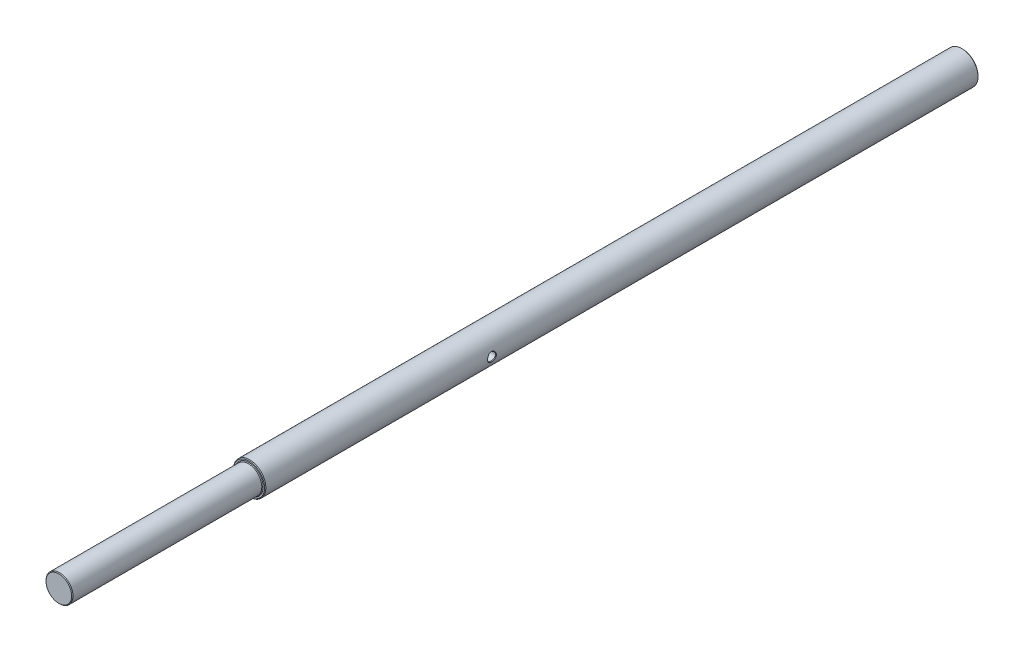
ISO-10303-21;
HEADER;
FILE_DESCRIPTION(('STEP AP214'),'2;1');
FILE_NAME('part.step','',(''),(''),'','','');
FILE_SCHEMA(('AUTOMOTIVE_DESIGN { 1 0 10303 214 1 1 1 1 }'));
ENDSEC;
DATA;
#1=APPLICATION_CONTEXT('core data for automotive mechanical design processes');
#2=APPLICATION_PROTOCOL_DEFINITION('international standard','automotive_design',2000,#1);
#3=PRODUCT_CONTEXT('',#1,'mechanical');
#4=PRODUCT('Part','Part','',(#3));
#5=PRODUCT_RELATED_PRODUCT_CATEGORY('part','',(#4));
#6=PRODUCT_DEFINITION_FORMATION('','',#4);
#7=PRODUCT_DEFINITION_CONTEXT('part definition',#1,'design');
#8=PRODUCT_DEFINITION('design','',#6,#7);
#9=PRODUCT_DEFINITION_SHAPE('','',#8);
#10=(LENGTH_UNIT() NAMED_UNIT(*) SI_UNIT(.MILLI.,.METRE.));
#11=(NAMED_UNIT(*) PLANE_ANGLE_UNIT() SI_UNIT($,.RADIAN.));
#12=(NAMED_UNIT(*) SI_UNIT($,.STERADIAN.) SOLID_ANGLE_UNIT());
#13=UNCERTAINTY_MEASURE_WITH_UNIT(LENGTH_MEASURE(1.E-05),#10,'distance_accuracy_value','');
#14=(GEOMETRIC_REPRESENTATION_CONTEXT(3) GLOBAL_UNCERTAINTY_ASSIGNED_CONTEXT((#13)) GLOBAL_UNIT_ASSIGNED_CONTEXT((#10,
#11,#12)) REPRESENTATION_CONTEXT('',''));
#15=CARTESIAN_POINT('',(0.,0.,0.));
#16=DIRECTION('',(0.,0.,1.));
#17=DIRECTION('',(1.,0.,0.));
#18=AXIS2_PLACEMENT_3D('',#15,#16,#17);
#19=CARTESIAN_POINT('',(0.,0.,70.5));
#20=DIRECTION('',(0.,0.,-1.));
#21=DIRECTION('',(-1.,0.,0.));
#22=AXIS2_PLACEMENT_3D('',#19,#20,#21);
#23=CYLINDRICAL_SURFACE('',#22,5.);
#24=CARTESIAN_POINT('',(0.,0.,0.249999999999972));
#25=DIRECTION('',(0.,0.,-1.));
#26=DIRECTION('',(-1.,0.,0.));
#27=AXIS2_PLACEMENT_3D('',#24,#25,#26);
#28=CIRCLE('',#27,5.);
#29=CARTESIAN_POINT('',(-5.,0.,0.249999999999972));
#30=VERTEX_POINT('',#29);
#31=EDGE_CURVE('E39',#30,#30,#28,.F.);
#32=ORIENTED_EDGE('',*,*,#31,.T.);
#33=EDGE_LOOP('',(#32));
#34=FACE_BOUND('',#33,.T.);
#35=CARTESIAN_POINT('',(0.,0.,70.25));
#36=DIRECTION('',(0.,0.,1.));
#37=DIRECTION('',(1.,0.,0.));
#38=AXIS2_PLACEMENT_3D('',#35,#36,#37);
#39=CIRCLE('',#38,5.);
#40=CARTESIAN_POINT('',(5.,0.,70.25));
#41=VERTEX_POINT('',#40);
#42=EDGE_CURVE('E44',#41,#41,#39,.F.);
#43=ORIENTED_EDGE('',*,*,#42,.T.);
#44=EDGE_LOOP('',(#43));
#45=FACE_BOUND('',#44,.T.);
#46=ADVANCED_FACE('F29',(#34,#45),#23,.T.);
#47=CARTESIAN_POINT('',(0.,0.,70.5));
#48=DIRECTION('',(0.,0.,1.));
#49=DIRECTION('',(1.,0.,0.));
#50=AXIS2_PLACEMENT_3D('',#47,#48,#49);
#51=PLANE('',#50);
#52=CARTESIAN_POINT('',(0.,0.,70.5));
#53=DIRECTION('',(0.,0.,1.));
#54=DIRECTION('',(1.,0.,0.));
#55=AXIS2_PLACEMENT_3D('',#52,#53,#54);
#56=CIRCLE('',#55,4.74999999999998);
#57=CARTESIAN_POINT('',(4.74999999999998,0.,70.5));
#58=VERTEX_POINT('',#57);
#59=EDGE_CURVE('E10',#58,#58,#56,.T.);
#60=ORIENTED_EDGE('',*,*,#59,.T.);
#61=EDGE_LOOP('',(#60));
#62=FACE_BOUND('',#61,.T.);
#63=ADVANCED_FACE('F160',(#62),#51,.T.);
#64=CARTESIAN_POINT('',(0.,0.,0.));
#65=DIRECTION('',(0.,0.,-1.));
#66=DIRECTION('',(-1.,0.,0.));
#67=AXIS2_PLACEMENT_3D('',#64,#65,#66);
#68=PLANE('',#67);
#69=CARTESIAN_POINT('',(0.,0.,0.));
#70=DIRECTION('',(0.,0.,-1.));
#71=DIRECTION('',(-1.,0.,0.));
#72=AXIS2_PLACEMENT_3D('',#69,#70,#71);
#73=CIRCLE('',#72,5.75000000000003);
#74=CARTESIAN_POINT('',(-5.75000000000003,0.,0.));
#75=VERTEX_POINT('',#74);
#76=EDGE_CURVE('E113',#75,#75,#73,.F.);
#77=ORIENTED_EDGE('',*,*,#76,.T.);
#78=EDGE_LOOP('',(#77));
#79=FACE_BOUND('',#78,.T.);
#80=CARTESIAN_POINT('',(0.,0.,0.));
#81=DIRECTION('',(0.,0.,-1.));
#82=DIRECTION('',(-1.,0.,0.));
#83=AXIS2_PLACEMENT_3D('',#80,#81,#82);
#84=CIRCLE('',#83,5.24999999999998);
#85=CARTESIAN_POINT('',(-5.24999999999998,0.,0.));
#86=VERTEX_POINT('',#85);
#87=EDGE_CURVE('E118',#86,#86,#84,.T.);
#88=ORIENTED_EDGE('',*,*,#87,.T.);
#89=EDGE_LOOP('',(#88));
#90=FACE_BOUND('',#89,.T.);
#91=ADVANCED_FACE('F166',(#79,#90),#68,.F.);
#92=CARTESIAN_POINT('',(0.,0.,-264.5));
#93=DIRECTION('',(0.,0.,1.));
#94=DIRECTION('',(1.,0.,0.));
#95=AXIS2_PLACEMENT_3D('',#92,#93,#94);
#96=CYLINDRICAL_SURFACE('',#95,6.);
#97=CARTESIAN_POINT('',(0.,0.,-0.250000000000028));
#98=DIRECTION('',(0.,0.,-1.));
#99=DIRECTION('',(-1.,0.,0.));
#100=AXIS2_PLACEMENT_3D('',#97,#98,#99);
#101=CIRCLE('',#100,6.);
#102=CARTESIAN_POINT('',(-6.,0.,-0.250000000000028));
#103=VERTEX_POINT('',#102);
#104=EDGE_CURVE('E179',#103,#103,#101,.T.);
#105=ORIENTED_EDGE('',*,*,#104,.T.);
#106=EDGE_LOOP('',(#105));
#107=FACE_BOUND('',#106,.T.);
#108=CARTESIAN_POINT('',(0.,0.,-264.25));
#109=DIRECTION('',(0.,0.,-1.));
#110=DIRECTION('',(-1.,0.,0.));
#111=AXIS2_PLACEMENT_3D('',#108,#109,#110);
#112=CIRCLE('',#111,6.);
#113=CARTESIAN_POINT('',(-6.,0.,-264.25));
#114=VERTEX_POINT('',#113);
#115=EDGE_CURVE('E181',#114,#114,#112,.F.);
#116=ORIENTED_EDGE('',*,*,#115,.T.);
#117=EDGE_LOOP('',(#116));
#118=FACE_BOUND('',#117,.T.);
#119=CARTESIAN_POINT('',(-6.00000000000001,0.,-85.728156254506));
#120=CARTESIAN_POINT('',(-6.00000384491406,-0.0279468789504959,-85.7281713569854));
#121=CARTESIAN_POINT('',(-5.9997883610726,-0.0558928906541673,-85.727490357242));
#122=CARTESIAN_POINT('',(-5.99894084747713,-0.111656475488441,-85.7247592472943));
#123=CARTESIAN_POINT('',(-5.99830964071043,-0.139474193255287,-85.7227118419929));
#124=CARTESIAN_POINT('',(-5.99665389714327,-0.194923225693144,-85.7172750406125));
#125=CARTESIAN_POINT('',(-5.99562995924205,-0.222554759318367,-85.7138876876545));
#126=CARTESIAN_POINT('',(-5.99321217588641,-0.277574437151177,-85.705798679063));
#127=CARTESIAN_POINT('',(-5.99181877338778,-0.30496283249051,-85.7010985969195));
#128=CARTESIAN_POINT('',(-5.98868534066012,-0.359439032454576,-85.6904114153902));
#129=CARTESIAN_POINT('',(-5.98694565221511,-0.386527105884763,-85.6844255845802));
#130=CARTESIAN_POINT('',(-5.98314289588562,-0.440345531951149,-85.6711940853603));
#131=CARTESIAN_POINT('',(-5.98108011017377,-0.467076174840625,-85.6639495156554));
#132=CARTESIAN_POINT('',(-5.97665436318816,-0.520122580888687,-85.6482275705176));
#133=CARTESIAN_POINT('',(-5.97429165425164,-0.546438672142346,-85.6397512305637));
#134=CARTESIAN_POINT('',(-5.96928923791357,-0.59859879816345,-85.6215926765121));
#135=CARTESIAN_POINT('',(-5.96664977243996,-0.624443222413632,-85.611911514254));
#136=CARTESIAN_POINT('',(-5.96111700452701,-0.675602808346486,-85.591370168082));
#137=CARTESIAN_POINT('',(-5.95822394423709,-0.700918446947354,-85.5805111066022));
#138=CARTESIAN_POINT('',(-5.9522071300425,-0.75096322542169,-85.5576407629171));
#139=CARTESIAN_POINT('',(-5.94908362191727,-0.775692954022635,-85.5456307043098));
#140=CARTESIAN_POINT('',(-5.94262908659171,-0.824508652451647,-85.5204851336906));
#141=CARTESIAN_POINT('',(-5.93929830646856,-0.848595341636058,-85.5073509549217));
#142=CARTESIAN_POINT('',(-5.93245227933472,-0.896067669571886,-85.4799839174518));
#143=CARTESIAN_POINT('',(-5.9289372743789,-0.919454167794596,-85.465752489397));
#144=CARTESIAN_POINT('',(-5.9217463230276,-0.965468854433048,-85.436217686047));
#145=CARTESIAN_POINT('',(-5.91807060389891,-0.98809803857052,-85.4209158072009));
#146=CARTESIAN_POINT('',(-5.9105800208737,-1.03254068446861,-85.3892670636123));
#147=CARTESIAN_POINT('',(-5.90676536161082,-1.05435525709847,-85.3729217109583));
#148=CARTESIAN_POINT('',(-5.89902517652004,-1.09711187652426,-85.3392122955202));
#149=CARTESIAN_POINT('',(-5.89509981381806,-1.11805510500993,-85.3218496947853));
#150=CARTESIAN_POINT('',(-5.88714240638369,-1.15901009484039,-85.2861348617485));
#151=CARTESIAN_POINT('',(-5.88311050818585,-1.17902304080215,-85.2677839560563));
#152=CARTESIAN_POINT('',(-5.87503586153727,-1.21805770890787,-85.2301201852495));
#153=CARTESIAN_POINT('',(-5.87099314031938,-1.23708094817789,-85.2108088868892));
#154=CARTESIAN_POINT('',(-5.86299552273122,-1.27410451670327,-85.1712802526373));
#155=CARTESIAN_POINT('',(-5.85904047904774,-1.29210665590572,-85.1510646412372));
#156=CARTESIAN_POINT('',(-5.85122510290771,-1.32705817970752,-85.1097855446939));
#157=CARTESIAN_POINT('',(-5.84736462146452,-1.34400929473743,-85.0887235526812));
#158=CARTESIAN_POINT('',(-5.83976927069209,-1.37683102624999,-85.0458070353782));
#159=CARTESIAN_POINT('',(-5.83603420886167,-1.39270334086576,-85.0239538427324));
#160=CARTESIAN_POINT('',(-5.82871418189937,-1.42333909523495,-84.9795109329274));
#161=CARTESIAN_POINT('',(-5.82512898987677,-1.43810424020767,-84.95692242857));
#162=CARTESIAN_POINT('',(-5.81813490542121,-1.46649739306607,-84.9110646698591));
#163=CARTESIAN_POINT('',(-5.81472574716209,-1.48012713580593,-84.8877965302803));
#164=CARTESIAN_POINT('',(-5.8081094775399,-1.50622115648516,-84.8406353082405));
#165=CARTESIAN_POINT('',(-5.80490206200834,-1.51868720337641,-84.8167432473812));
#166=CARTESIAN_POINT('',(-5.7987151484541,-1.54242551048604,-84.7683899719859));
#167=CARTESIAN_POINT('',(-5.79573531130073,-1.55369955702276,-84.7439296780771));
#168=CARTESIAN_POINT('',(-5.79002938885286,-1.57502555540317,-84.6944957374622));
#169=CARTESIAN_POINT('',(-5.78730293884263,-1.58507927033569,-84.6695228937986));
#170=CARTESIAN_POINT('',(-5.78212962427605,-1.60393633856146,-84.6191196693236));
#171=CARTESIAN_POINT('',(-5.77968238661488,-1.61274136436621,-84.5936899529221));
#172=CARTESIAN_POINT('',(-5.77509330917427,-1.62907285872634,-84.5424288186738));
#173=CARTESIAN_POINT('',(-5.77295111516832,-1.63660081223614,-84.5165979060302));
#174=CARTESIAN_POINT('',(-5.76899791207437,-1.65035005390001,-84.4645902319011));
#175=CARTESIAN_POINT('',(-5.76718660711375,-1.65657251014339,-84.438413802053));
#176=CARTESIAN_POINT('',(-5.76392091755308,-1.66768282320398,-84.3857709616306));
#177=CARTESIAN_POINT('',(-5.76246634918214,-1.67257136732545,-84.3593047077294));
#178=CARTESIAN_POINT('',(-5.75993984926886,-1.68098593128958,-84.3061380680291));
#179=CARTESIAN_POINT('',(-5.75886791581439,-1.68451195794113,-84.2794376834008));
#180=CARTESIAN_POINT('',(-5.75713219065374,-1.69017435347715,-84.225858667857));
#181=CARTESIAN_POINT('',(-5.756468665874,-1.69230981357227,-84.1989799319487));
#182=CARTESIAN_POINT('',(-5.75557569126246,-1.69516198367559,-84.1450998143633));
#183=CARTESIAN_POINT('',(-5.75534688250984,-1.69587659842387,-84.1180983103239));
#184=CARTESIAN_POINT('',(-5.75534722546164,-1.69586648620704,-84.0640952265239));
#185=CARTESIAN_POINT('',(-5.75557638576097,-1.69514173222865,-84.0370936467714));
#186=CARTESIAN_POINT('',(-5.75646731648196,-1.69228127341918,-83.9832124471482));
#187=CARTESIAN_POINT('',(-5.7571284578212,-1.69014762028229,-83.9563327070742));
#188=CARTESIAN_POINT('',(-5.75885779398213,-1.68449632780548,-83.9027504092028));
#189=CARTESIAN_POINT('',(-5.75992572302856,-1.6809795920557,-83.876047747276));
#190=CARTESIAN_POINT('',(-5.76244268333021,-1.67259099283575,-83.8228748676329));
#191=CARTESIAN_POINT('',(-5.7638917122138,-1.66771913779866,-83.7964046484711));
#192=CARTESIAN_POINT('',(-5.76714515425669,-1.6566483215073,-83.7437518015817));
#193=CARTESIAN_POINT('',(-5.76894974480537,-1.65044869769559,-83.7175693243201));
#194=CARTESIAN_POINT('',(-5.77288863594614,-1.63675029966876,-83.665547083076));
#195=CARTESIAN_POINT('',(-5.77502322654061,-1.62925038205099,-83.6397076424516));
#196=CARTESIAN_POINT('',(-5.77959651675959,-1.6129791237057,-83.5884265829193));
#197=CARTESIAN_POINT('',(-5.78203556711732,-1.60420631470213,-83.5629854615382));
#198=CARTESIAN_POINT('',(-5.78719222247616,-1.58541685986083,-83.5125561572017));
#199=CARTESIAN_POINT('',(-5.78991020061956,-1.57539854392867,-83.4875686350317));
#200=CARTESIAN_POINT('',(-5.79559919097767,-1.55414553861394,-83.4381016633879));
#201=CARTESIAN_POINT('',(-5.79857057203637,-1.54290906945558,-83.4136230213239));
#202=CARTESIAN_POINT('',(-5.80474088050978,-1.51924713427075,-83.3652289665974));
#203=CARTESIAN_POINT('',(-5.80794015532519,-1.50681984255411,-83.3413144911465));
#204=CARTESIAN_POINT('',(-5.81454074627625,-1.48080357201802,-83.2941039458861));
#205=CARTESIAN_POINT('',(-5.8179423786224,-1.46721275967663,-83.2708089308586));
#206=CARTESIAN_POINT('',(-5.82492231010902,-1.43889674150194,-83.2248925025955));
#207=CARTESIAN_POINT('',(-5.82850089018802,-1.42416970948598,-83.2022722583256));
#208=CARTESIAN_POINT('',(-5.83580888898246,-1.39360845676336,-83.1577605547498));
#209=CARTESIAN_POINT('',(-5.83953855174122,-1.3777724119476,-83.1358703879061));
#210=CARTESIAN_POINT('',(-5.84712459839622,-1.34502062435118,-83.0928740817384));
#211=CARTESIAN_POINT('',(-5.85098119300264,-1.32810303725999,-83.0717693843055));
#212=CARTESIAN_POINT('',(-5.85879058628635,-1.29321463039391,-83.0303989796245));
#213=CARTESIAN_POINT('',(-5.86274355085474,-1.2752419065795,-83.0101349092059));
#214=CARTESIAN_POINT('',(-5.87073911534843,-1.23827365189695,-82.9705016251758));
#215=CARTESIAN_POINT('',(-5.87478188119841,-1.21927611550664,-82.9511343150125));
#216=CARTESIAN_POINT('',(-5.88285828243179,-1.18028636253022,-82.9133587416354));
#217=CARTESIAN_POINT('',(-5.88689189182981,-1.16029256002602,-82.8949521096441));
#218=CARTESIAN_POINT('',(-5.89485352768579,-1.1193680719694,-82.8591341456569));
#219=CARTESIAN_POINT('',(-5.89878141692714,-1.09843625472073,-82.8417240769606));
#220=CARTESIAN_POINT('',(-5.90652741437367,-1.05569695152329,-82.8079259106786));
#221=CARTESIAN_POINT('',(-5.91034536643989,-1.03388831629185,-82.7915392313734));
#222=CARTESIAN_POINT('',(-5.91784321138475,-0.989452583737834,-82.7598137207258));
#223=CARTESIAN_POINT('',(-5.92152290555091,-0.96682439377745,-82.7444763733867));
#224=CARTESIAN_POINT('',(-5.92872240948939,-0.920807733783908,-82.7148757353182));
#225=CARTESIAN_POINT('',(-5.93224199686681,-0.897418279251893,-82.7006139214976));
#226=CARTESIAN_POINT('',(-5.93909771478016,-0.84993694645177,-82.6731905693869));
#227=CARTESIAN_POINT('',(-5.9424336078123,-0.82584421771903,-82.6600304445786));
#228=CARTESIAN_POINT('',(-5.94889881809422,-0.77701424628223,-82.6348367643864));
#229=CARTESIAN_POINT('',(-5.95202789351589,-0.752276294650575,-82.6228045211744));
#230=CARTESIAN_POINT('',(-5.95805621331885,-0.702213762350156,-82.5998929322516));
#231=CARTESIAN_POINT('',(-5.96095521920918,-0.676888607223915,-82.5890147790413));
#232=CARTESIAN_POINT('',(-5.96650016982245,-0.625709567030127,-82.5684377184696));
#233=CARTESIAN_POINT('',(-5.96914588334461,-0.599855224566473,-82.558739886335));
#234=CARTESIAN_POINT('',(-5.97416100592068,-0.547675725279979,-82.5405498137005));
#235=CARTESIAN_POINT('',(-5.97653018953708,-0.521350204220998,-82.5320585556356));
#236=CARTESIAN_POINT('',(-5.98096901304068,-0.468286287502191,-82.5163079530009));
#237=CARTESIAN_POINT('',(-5.98303842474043,-0.441547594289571,-82.5090495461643));
#238=CARTESIAN_POINT('',(-5.98685447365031,-0.387715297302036,-82.4957909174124));
#239=CARTESIAN_POINT('',(-5.98860086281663,-0.360621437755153,-82.4897916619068));
#240=CARTESIAN_POINT('',(-5.9917476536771,-0.30613679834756,-82.4790775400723));
#241=CARTESIAN_POINT('',(-5.99314776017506,-0.278745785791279,-82.474363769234));
#242=CARTESIAN_POINT('',(-5.99557880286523,-0.223724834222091,-82.4662466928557));
#243=CARTESIAN_POINT('',(-5.9966093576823,-0.196094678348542,-82.4628447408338));
#244=CARTESIAN_POINT('',(-5.9982781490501,-0.140653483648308,-82.4573773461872));
#245=CARTESIAN_POINT('',(-5.99891586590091,-0.112842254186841,-82.4553136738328));
#246=CARTESIAN_POINT('',(-5.99977590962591,-0.0570967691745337,-82.4525483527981));
#247=CARTESIAN_POINT('',(-5.99999751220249,-0.0291623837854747,-82.4518490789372));
#248=CARTESIAN_POINT('',(-6.00000223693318,0.0267114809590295,-82.4518392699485));
#249=CARTESIAN_POINT('',(-5.99978528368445,0.0546509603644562,-82.4525289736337));
#250=CARTESIAN_POINT('',(-5.9989345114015,0.110415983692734,-82.4552764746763));
#251=CARTESIAN_POINT('',(-5.998301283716,0.138241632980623,-82.4573323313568));
#252=CARTESIAN_POINT('',(-5.99664145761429,0.193719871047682,-82.4627843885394));
#253=CARTESIAN_POINT('',(-5.99561526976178,0.221372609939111,-82.4661791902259));
#254=CARTESIAN_POINT('',(-5.99319290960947,0.276445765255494,-82.4742820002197));
#255=CARTESIAN_POINT('',(-5.99179703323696,0.303866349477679,-82.4789889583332));
#256=CARTESIAN_POINT('',(-5.98865862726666,0.358415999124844,-82.4896890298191));
#257=CARTESIAN_POINT('',(-5.98691633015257,0.385545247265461,-82.4956812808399));
#258=CARTESIAN_POINT('',(-5.98310836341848,0.439453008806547,-82.5089250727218));
#259=CARTESIAN_POINT('',(-5.9810429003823,0.466231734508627,-82.5161758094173));
#260=CARTESIAN_POINT('',(-5.97661184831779,0.519379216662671,-82.5319098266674));
#261=CARTESIAN_POINT('',(-5.97424646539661,0.545748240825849,-82.5403922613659));
#262=CARTESIAN_POINT('',(-5.96923879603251,0.598017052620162,-82.5585630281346));
#263=CARTESIAN_POINT('',(-5.96659673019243,0.623917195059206,-82.5682504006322));
#264=CARTESIAN_POINT('',(-5.96105890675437,0.675188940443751,-82.5888044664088));
#265=CARTESIAN_POINT('',(-5.9581633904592,0.700561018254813,-82.5996700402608));
#266=CARTESIAN_POINT('',(-5.95214186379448,0.750717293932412,-82.6225539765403));
#267=CARTESIAN_POINT('',(-5.94901611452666,0.775502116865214,-82.6345710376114));
#268=CARTESIAN_POINT('',(-5.94255735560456,0.824424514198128,-82.6597314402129));
#269=CARTESIAN_POINT('',(-5.93922462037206,0.848562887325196,-82.672873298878));
#270=CARTESIAN_POINT('',(-5.93237500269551,0.896132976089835,-82.7002567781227));
#271=CARTESIAN_POINT('',(-5.92885839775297,0.919565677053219,-82.7144967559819));
#272=CARTESIAN_POINT('',(-5.92166463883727,0.965665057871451,-82.7440499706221));
#273=CARTESIAN_POINT('',(-5.91798775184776,0.988332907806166,-82.7593614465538));
#274=CARTESIAN_POINT('',(-5.91049527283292,1.0328430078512,-82.7910309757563));
#275=CARTESIAN_POINT('',(-5.90667992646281,1.05468659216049,-82.8073872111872));
#276=CARTESIAN_POINT('',(-5.89893896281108,1.09748941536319,-82.841120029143));
#277=CARTESIAN_POINT('',(-5.89501354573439,1.11845010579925,-82.8584948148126));
#278=CARTESIAN_POINT('',(-5.88705640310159,1.15942542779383,-82.8942365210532));
#279=CARTESIAN_POINT('',(-5.88302486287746,1.1794415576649,-82.912601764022));
#280=CARTESIAN_POINT('',(-5.87495162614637,1.21847236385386,-82.9502983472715));
#281=CARTESIAN_POINT('',(-5.87090995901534,1.23748870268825,-82.9696279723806));
#282=CARTESIAN_POINT('',(-5.86291527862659,1.27449567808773,-83.0091972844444));
#283=CARTESIAN_POINT('',(-5.85896212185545,1.29248806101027,-83.0294353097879));
#284=CARTESIAN_POINT('',(-5.85115095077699,1.32741727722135,-83.0707628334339));
#285=CARTESIAN_POINT('',(-5.84729279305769,1.34435576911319,-83.0918509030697));
#286=CARTESIAN_POINT('',(-5.83970247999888,1.37715030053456,-83.1348219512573));
#287=CARTESIAN_POINT('',(-5.83597014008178,1.39300796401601,-83.1567036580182));
#288=CARTESIAN_POINT('',(-5.8286558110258,1.42361306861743,-83.2012049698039));
#289=CARTESIAN_POINT('',(-5.82507360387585,1.43836214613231,-83.2238234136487));
#290=CARTESIAN_POINT('',(-5.81808563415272,1.46672247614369,-83.2697413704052));
#291=CARTESIAN_POINT('',(-5.81467961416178,1.48033540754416,-83.2930398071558));
#292=CARTESIAN_POINT('',(-5.80806965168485,1.50639575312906,-83.3402609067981));
#293=CARTESIAN_POINT('',(-5.80486541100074,1.51884490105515,-83.3641825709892));
#294=CARTESIAN_POINT('',(-5.79868476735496,1.54254998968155,-83.4125932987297));
#295=CARTESIAN_POINT('',(-5.79570802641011,1.55380771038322,-83.4370814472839));
#296=CARTESIAN_POINT('',(-5.79000810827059,1.57510225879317,-83.4865683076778));
#297=CARTESIAN_POINT('',(-5.78728455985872,1.58514088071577,-83.5115662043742));
#298=CARTESIAN_POINT('',(-5.78211675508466,1.60396957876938,-83.5620157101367));
#299=CARTESIAN_POINT('',(-5.77967210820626,1.61276140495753,-83.587466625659));
#300=CARTESIAN_POINT('',(-5.7750878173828,1.62906891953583,-83.6387652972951));
#301=CARTESIAN_POINT('',(-5.77294778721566,1.63658622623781,-83.6646125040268));
#302=CARTESIAN_POINT('',(-5.76899841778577,1.65031719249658,-83.7166468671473));
#303=CARTESIAN_POINT('',(-5.7671887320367,1.65653221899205,-83.7428336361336));
#304=CARTESIAN_POINT('',(-5.76392569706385,1.66763126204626,-83.7954902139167));
#305=CARTESIAN_POINT('',(-5.76247209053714,1.67251623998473,-83.8219598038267));
#306=CARTESIAN_POINT('',(-5.75994682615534,1.68092788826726,-83.8751251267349));
#307=CARTESIAN_POINT('',(-5.75887506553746,1.68445492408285,-83.9018207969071));
#308=CARTESIAN_POINT('',(-5.75713896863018,1.69012392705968,-83.9553813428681));
#309=CARTESIAN_POINT('',(-5.75647476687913,1.69226543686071,-83.9822462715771));
#310=CARTESIAN_POINT('',(-5.75557943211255,1.69513557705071,-84.0360886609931));
#311=CARTESIAN_POINT('',(-5.7553487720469,1.6958626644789,-84.0630662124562));
#312=CARTESIAN_POINT('',(-5.75534511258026,1.69588117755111,-84.1170159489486));
#313=CARTESIAN_POINT('',(-5.75557201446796,1.69517291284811,-84.1439881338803));
#314=CARTESIAN_POINT('',(-5.7564587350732,1.69234632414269,-84.1978102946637));
#315=CARTESIAN_POINT('',(-5.75711790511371,1.6902301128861,-84.2246603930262));
#316=CARTESIAN_POINT('',(-5.75884339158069,1.68461472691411,-84.2781832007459));
#317=CARTESIAN_POINT('',(-5.75990942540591,1.68111651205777,-84.3048560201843));
#318=CARTESIAN_POINT('',(-5.76242273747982,1.67276519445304,-84.3579690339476));
#319=CARTESIAN_POINT('',(-5.76387000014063,1.66791214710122,-84.3844092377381));
#320=CARTESIAN_POINT('',(-5.76712002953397,1.65687865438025,-84.437001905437));
#321=CARTESIAN_POINT('',(-5.76892296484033,1.65069757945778,-84.4631542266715));
#322=CARTESIAN_POINT('',(-5.77285866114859,1.63703539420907,-84.5151160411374));
#323=CARTESIAN_POINT('',(-5.77499170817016,1.62955315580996,-84.5409252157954));
#324=CARTESIAN_POINT('',(-5.77956201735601,1.6133157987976,-84.5921456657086));
#325=CARTESIAN_POINT('',(-5.78199963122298,1.60455920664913,-84.6175564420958));
#326=CARTESIAN_POINT('',(-5.78715351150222,1.58580015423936,-84.6679250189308));
#327=CARTESIAN_POINT('',(-5.78987015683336,1.57579599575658,-84.6928821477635));
#328=CARTESIAN_POINT('',(-5.79555657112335,1.55456870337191,-84.7422883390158));
#329=CARTESIAN_POINT('',(-5.79852671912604,1.54334373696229,-84.7667365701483));
#330=CARTESIAN_POINT('',(-5.80469464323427,1.5197016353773,-84.8150698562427));
#331=CARTESIAN_POINT('',(-5.80789278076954,1.5072825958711,-84.838953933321));
#332=CARTESIAN_POINT('',(-5.814491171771,1.48127909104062,-84.8861037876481));
#333=CARTESIAN_POINT('',(-5.81789175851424,1.46769268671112,-84.909368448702));
#334=CARTESIAN_POINT('',(-5.82486966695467,1.43938117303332,-84.955224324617));
#335=CARTESIAN_POINT('',(-5.8284472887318,1.42465410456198,-84.9778142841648));
#336=CARTESIAN_POINT('',(-5.83575343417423,1.39408792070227,-85.0222656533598));
#337=CARTESIAN_POINT('',(-5.83948222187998,1.37824682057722,-85.044125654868));
#338=CARTESIAN_POINT('',(-5.84706657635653,1.3454794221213,-85.0870618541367));
#339=CARTESIAN_POINT('',(-5.85092237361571,1.32855109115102,-85.1081364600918));
#340=CARTESIAN_POINT('',(-5.85873023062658,1.29363541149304,-85.1494472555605));
#341=CARTESIAN_POINT('',(-5.86268247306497,1.27564594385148,-85.1696816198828));
#342=CARTESIAN_POINT('',(-5.87067664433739,1.23863679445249,-85.2092550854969));
#343=CARTESIAN_POINT('',(-5.87471875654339,1.21961486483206,-85.2285920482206));
#344=CARTESIAN_POINT('',(-5.88279406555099,1.18057151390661,-85.2663113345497));
#345=CARTESIAN_POINT('',(-5.88682722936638,1.16054820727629,-85.2846917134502));
#346=CARTESIAN_POINT('',(-5.89478846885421,1.11956302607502,-85.32046621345));
#347=CARTESIAN_POINT('',(-5.89871636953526,1.09859972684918,-85.3378587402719));
#348=CARTESIAN_POINT('',(-5.90646283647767,1.05579518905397,-85.3716289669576));
#349=CARTESIAN_POINT('',(-5.91028121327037,1.03395256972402,-85.3880049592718));
#350=CARTESIAN_POINT('',(-5.91778030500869,0.989447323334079,-85.4197157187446));
#351=CARTESIAN_POINT('',(-5.92146078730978,0.966783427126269,-85.4350487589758));
#352=CARTESIAN_POINT('',(-5.92866221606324,0.92069419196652,-85.4646465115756));
#353=CARTESIAN_POINT('',(-5.93218290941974,0.897267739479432,-85.4789095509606));
#354=CARTESIAN_POINT('',(-5.93904113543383,0.849711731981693,-85.5063402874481));
#355=CARTESIAN_POINT('',(-5.94237840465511,0.825581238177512,-85.5195064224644));
#356=CARTESIAN_POINT('',(-5.94884660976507,0.776675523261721,-85.5447162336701));
#357=CARTESIAN_POINT('',(-5.95197728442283,0.751899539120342,-85.5567584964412));
#358=CARTESIAN_POINT('',(-5.95800898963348,0.70176120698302,-85.5796934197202));
#359=CARTESIAN_POINT('',(-5.96090977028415,0.676398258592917,-85.5905848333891));
#360=CARTESIAN_POINT('',(-5.96645840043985,0.62514437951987,-85.6111908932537));
#361=CARTESIAN_POINT('',(-5.9691060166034,0.599252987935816,-85.6209044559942));
#362=CARTESIAN_POINT('',(-5.97412501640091,0.547000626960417,-85.6391276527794));
#363=CARTESIAN_POINT('',(-5.97649618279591,0.520639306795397,-85.6476363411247));
#364=CARTESIAN_POINT('',(-5.98093898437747,0.467505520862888,-85.6634226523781));
#365=CARTESIAN_POINT('',(-5.98301041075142,0.440732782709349,-85.6706994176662));
#366=CARTESIAN_POINT('',(-5.98683044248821,0.386834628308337,-85.6839947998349));
#367=CARTESIAN_POINT('',(-5.98857883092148,0.359708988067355,-85.6900125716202));
#368=CARTESIAN_POINT('',(-5.99172950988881,0.305163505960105,-85.7007629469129));
#369=CARTESIAN_POINT('',(-5.99313154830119,0.277743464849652,-85.7054946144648));
#370=CARTESIAN_POINT('',(-5.9955662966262,0.222667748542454,-85.7136459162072));
#371=CARTESIAN_POINT('',(-5.99659868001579,0.195011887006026,-85.7170643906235));
#372=CARTESIAN_POINT('',(-5.99827086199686,0.139522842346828,-85.7225623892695));
#373=CARTESIAN_POINT('',(-5.99891020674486,0.111689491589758,-85.7246403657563));
#374=CARTESIAN_POINT('',(-5.99977335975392,0.0559047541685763,-85.7274313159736));
#375=CARTESIAN_POINT('',(-5.99999651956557,0.0279532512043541,-85.7281421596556));
#376=CARTESIAN_POINT('',(-6.00000000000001,0.,-85.728156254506));
#377=B_SPLINE_CURVE_WITH_KNOTS('',3,(#119,#120,#121,#122,#123,#124,#125,#126,#127,#128,#129,
#130,#131,#132,#133,#134,#135,#136,#137,#138,#139,#140,#141,#142,#143,#144,#145,#146,#147,#148,
#149,#150,#151,#152,#153,#154,#155,#156,#157,#158,#159,#160,#161,#162,#163,#164,#165,#166,#167,
#168,#169,#170,#171,#172,#173,#174,#175,#176,#177,#178,#179,#180,#181,#182,#183,#184,#185,#186,
#187,#188,#189,#190,#191,#192,#193,#194,#195,#196,#197,#198,#199,#200,#201,#202,#203,#204,#205,
#206,#207,#208,#209,#210,#211,#212,#213,#214,#215,#216,#217,#218,#219,#220,#221,#222,#223,#224,
#225,#226,#227,#228,#229,#230,#231,#232,#233,#234,#235,#236,#237,#238,#239,#240,#241,#242,#243,
#244,#245,#246,#247,#248,#249,#250,#251,#252,#253,#254,#255,#256,#257,#258,#259,#260,#261,#262,
#263,#264,#265,#266,#267,#268,#269,#270,#271,#272,#273,#274,#275,#276,#277,#278,#279,#280,#281,
#282,#283,#284,#285,#286,#287,#288,#289,#290,#291,#292,#293,#294,#295,#296,#297,#298,#299,#300,
#301,#302,#303,#304,#305,#306,#307,#308,#309,#310,#311,#312,#313,#314,#315,#316,#317,#318,#319,
#320,#321,#322,#323,#324,#325,#326,#327,#328,#329,#330,#331,#332,#333,#334,#335,#336,#337,#338,
#339,#340,#341,#342,#343,#344,#345,#346,#347,#348,#349,#350,#351,#352,#353,#354,#355,#356,#357,
#358,#359,#360,#361,#362,#363,#364,#365,#366,#367,#368,#369,#370,#371,#372,#373,#374,#375,#376),
.UNSPECIFIED.,.F.,.F.,(4,2,2,2,2,2,2,2,2,2,2,2,2,2,2,2,2,2,2,2,2,2,2,2,2,2,2,2,2,2,2,2,2,2,2,2,
2,2,2,2,2,2,2,2,2,2,2,2,2,2,2,2,2,2,2,2,2,2,2,2,2,2,2,2,2,2,2,2,2,2,2,2,2,2,2,2,2,2,2,2,2,2,2,2,
2,2,2,2,2,2,2,2,2,2,2,2,2,2,2,2,2,2,2,2,2,2,2,2,2,2,2,2,2,2,2,2,2,2,2,2,2,2,2,2,2,2,2,2,4),(0.,
0.0838292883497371,0.167493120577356,0.251029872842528,0.334466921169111,0.417822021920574,
0.501104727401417,0.584317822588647,0.667458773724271,0.750521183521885,0.83349625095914,
0.916374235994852,0.999145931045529,1.08180414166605,1.16434517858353,1.24677036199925,
1.32908753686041,1.41127456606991,1.4933110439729,1.57520865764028,1.6569742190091,
1.7386111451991,1.82012095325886,1.90150476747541,1.98276483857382,2.06390607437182,
2.14493758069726,2.22587420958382,2.30673810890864,2.38756026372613,2.46838201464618,
2.549256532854,2.63025022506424,2.71124543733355,2.79212296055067,2.87294773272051,
2.95377200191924,3.03463669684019,3.11557286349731,3.19660314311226,3.2777432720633,
3.3590035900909,3.44039054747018,3.52190820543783,3.60355972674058,3.68534885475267,
3.76728138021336,3.84936659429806,3.93161872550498,4.01400625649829,4.09649601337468,
4.17909766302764,4.26181381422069,4.34464155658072,4.42757398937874,4.51060173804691,
4.59371445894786,4.67690233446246,4.76015756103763,4.84347583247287,4.92685781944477,
5.01031064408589,5.09384934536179,5.17749832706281,5.26129277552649,5.34510163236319,
5.42879168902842,5.51239454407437,5.59593067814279,5.67941093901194,5.76283805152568,
5.84620813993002,5.92951225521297,6.01273790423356,6.0958705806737,6.17889530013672,
6.26179814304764,6.34456780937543,6.42719718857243,6.50968494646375,6.59203712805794,
6.67424773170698,6.75631364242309,6.83824694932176,6.92005430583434,7.0017384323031,
7.08329963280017,7.16473732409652,7.24605157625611,7.32724466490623,7.40832263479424,
7.48929687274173,7.57018568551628,7.65101587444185,7.73182429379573,7.81265937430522,
7.89358258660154,7.97448834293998,8.05527296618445,8.13600157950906,8.21672689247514,
8.29749055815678,8.37832459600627,8.45925285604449,8.54029250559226,8.6214555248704,
8.7027502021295,8.78418262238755,8.86575814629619,8.9474828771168,9.02936511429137,
9.11141679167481,9.19365489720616,9.27605413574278,9.35858278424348,9.44124650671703,
9.52404393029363,9.60696822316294,9.69000865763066,9.77315215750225,9.85638483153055,
9.93969349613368,10.0230671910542,10.1064986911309,10.1899860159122,10.2735339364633,
10.3571554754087,10.4408733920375,10.5247216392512),.UNSPECIFIED.);
#378=CARTESIAN_POINT('',(-6.00000000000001,0.,-85.728156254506));
#379=VERTEX_POINT('',#378);
#380=EDGE_CURVE('E52',#379,#379,#377,.F.);
#381=ORIENTED_EDGE('',*,*,#380,.T.);
#382=EDGE_LOOP('',(#381));
#383=FACE_BOUND('',#382,.T.);
#384=CARTESIAN_POINT('',(6.,0.,-85.728156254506));
#385=CARTESIAN_POINT('',(6.00000384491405,0.0279468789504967,-85.7281713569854));
#386=CARTESIAN_POINT('',(5.99978836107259,0.055892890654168,-85.727490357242));
#387=CARTESIAN_POINT('',(5.99894084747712,0.111656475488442,-85.7247592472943));
#388=CARTESIAN_POINT('',(5.99830964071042,0.139474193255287,-85.7227118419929));
#389=CARTESIAN_POINT('',(5.99665389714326,0.194923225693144,-85.7172750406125));
#390=CARTESIAN_POINT('',(5.99562995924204,0.222554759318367,-85.7138876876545));
#391=CARTESIAN_POINT('',(5.9932121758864,0.277574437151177,-85.705798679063));
#392=CARTESIAN_POINT('',(5.99181877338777,0.30496283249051,-85.7010985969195));
#393=CARTESIAN_POINT('',(5.98868534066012,0.359439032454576,-85.6904114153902));
#394=CARTESIAN_POINT('',(5.9869456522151,0.386527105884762,-85.6844255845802));
#395=CARTESIAN_POINT('',(5.98314289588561,0.440345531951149,-85.6711940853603));
#396=CARTESIAN_POINT('',(5.98108011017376,0.467076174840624,-85.6639495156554));
#397=CARTESIAN_POINT('',(5.97665436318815,0.520122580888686,-85.6482275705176));
#398=CARTESIAN_POINT('',(5.97429165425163,0.546438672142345,-85.6397512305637));
#399=CARTESIAN_POINT('',(5.96928923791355,0.598598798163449,-85.6215926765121));
#400=CARTESIAN_POINT('',(5.96664977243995,0.62444322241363,-85.611911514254));
#401=CARTESIAN_POINT('',(5.961117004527,0.675602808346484,-85.591370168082));
#402=CARTESIAN_POINT('',(5.95822394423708,0.700918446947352,-85.5805111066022));
#403=CARTESIAN_POINT('',(5.95220713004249,0.750963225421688,-85.5576407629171));
#404=CARTESIAN_POINT('',(5.94908362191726,0.775692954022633,-85.5456307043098));
#405=CARTESIAN_POINT('',(5.9426290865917,0.824508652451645,-85.5204851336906));
#406=CARTESIAN_POINT('',(5.93929830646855,0.848595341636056,-85.5073509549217));
#407=CARTESIAN_POINT('',(5.93245227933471,0.896067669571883,-85.4799839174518));
#408=CARTESIAN_POINT('',(5.9289372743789,0.919454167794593,-85.465752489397));
#409=CARTESIAN_POINT('',(5.92174632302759,0.965468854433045,-85.436217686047));
#410=CARTESIAN_POINT('',(5.91807060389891,0.988098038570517,-85.4209158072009));
#411=CARTESIAN_POINT('',(5.91058002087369,1.03254068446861,-85.3892670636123));
#412=CARTESIAN_POINT('',(5.90676536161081,1.05435525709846,-85.3729217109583));
#413=CARTESIAN_POINT('',(5.89902517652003,1.09711187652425,-85.3392122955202));
#414=CARTESIAN_POINT('',(5.89509981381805,1.11805510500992,-85.3218496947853));
#415=CARTESIAN_POINT('',(5.88714240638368,1.15901009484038,-85.2861348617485));
#416=CARTESIAN_POINT('',(5.88311050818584,1.17902304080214,-85.2677839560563));
#417=CARTESIAN_POINT('',(5.87503586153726,1.21805770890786,-85.2301201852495));
#418=CARTESIAN_POINT('',(5.87099314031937,1.23708094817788,-85.2108088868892));
#419=CARTESIAN_POINT('',(5.86299552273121,1.27410451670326,-85.1712802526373));
#420=CARTESIAN_POINT('',(5.85904047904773,1.29210665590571,-85.1510646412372));
#421=CARTESIAN_POINT('',(5.8512251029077,1.32705817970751,-85.1097855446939));
#422=CARTESIAN_POINT('',(5.84736462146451,1.34400929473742,-85.0887235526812));
#423=CARTESIAN_POINT('',(5.83976927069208,1.37683102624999,-85.0458070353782));
#424=CARTESIAN_POINT('',(5.83603420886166,1.39270334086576,-85.0239538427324));
#425=CARTESIAN_POINT('',(5.82871418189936,1.42333909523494,-84.9795109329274));
#426=CARTESIAN_POINT('',(5.82512898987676,1.43810424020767,-84.95692242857));
#427=CARTESIAN_POINT('',(5.8181349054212,1.46649739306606,-84.9110646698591));
#428=CARTESIAN_POINT('',(5.81472574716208,1.48012713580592,-84.8877965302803));
#429=CARTESIAN_POINT('',(5.80810947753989,1.50622115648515,-84.8406353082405));
#430=CARTESIAN_POINT('',(5.80490206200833,1.5186872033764,-84.8167432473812));
#431=CARTESIAN_POINT('',(5.79871514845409,1.54242551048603,-84.7683899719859));
#432=CARTESIAN_POINT('',(5.79573531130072,1.55369955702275,-84.7439296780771));
#433=CARTESIAN_POINT('',(5.79002938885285,1.57502555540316,-84.6944957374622));
#434=CARTESIAN_POINT('',(5.78730293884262,1.58507927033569,-84.6695228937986));
#435=CARTESIAN_POINT('',(5.78212962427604,1.60393633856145,-84.6191196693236));
#436=CARTESIAN_POINT('',(5.77968238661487,1.6127413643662,-84.5936899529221));
#437=CARTESIAN_POINT('',(5.77509330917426,1.62907285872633,-84.5424288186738));
#438=CARTESIAN_POINT('',(5.77295111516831,1.63660081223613,-84.5165979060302));
#439=CARTESIAN_POINT('',(5.76899791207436,1.6503500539,-84.4645902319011));
#440=CARTESIAN_POINT('',(5.76718660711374,1.65657251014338,-84.438413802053));
#441=CARTESIAN_POINT('',(5.76392091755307,1.66768282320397,-84.3857709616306));
#442=CARTESIAN_POINT('',(5.76246634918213,1.67257136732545,-84.3593047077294));
#443=CARTESIAN_POINT('',(5.75993984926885,1.68098593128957,-84.3061380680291));
#444=CARTESIAN_POINT('',(5.75886791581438,1.68451195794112,-84.2794376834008));
#445=CARTESIAN_POINT('',(5.75713219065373,1.69017435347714,-84.225858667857));
#446=CARTESIAN_POINT('',(5.756468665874,1.69230981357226,-84.1989799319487));
#447=CARTESIAN_POINT('',(5.75557569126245,1.69516198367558,-84.1450998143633));
#448=CARTESIAN_POINT('',(5.75534688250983,1.69587659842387,-84.1180983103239));
#449=CARTESIAN_POINT('',(5.75534722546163,1.69586648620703,-84.0640952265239));
#450=CARTESIAN_POINT('',(5.75557638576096,1.69514173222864,-84.0370936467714));
#451=CARTESIAN_POINT('',(5.75646731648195,1.69228127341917,-83.9832124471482));
#452=CARTESIAN_POINT('',(5.75712845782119,1.69014762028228,-83.9563327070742));
#453=CARTESIAN_POINT('',(5.75885779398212,1.68449632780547,-83.9027504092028));
#454=CARTESIAN_POINT('',(5.75992572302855,1.68097959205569,-83.876047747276));
#455=CARTESIAN_POINT('',(5.7624426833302,1.67259099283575,-83.8228748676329));
#456=CARTESIAN_POINT('',(5.76389171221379,1.66771913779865,-83.7964046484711));
#457=CARTESIAN_POINT('',(5.76714515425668,1.65664832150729,-83.7437518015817));
#458=CARTESIAN_POINT('',(5.76894974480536,1.65044869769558,-83.7175693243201));
#459=CARTESIAN_POINT('',(5.77288863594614,1.63675029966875,-83.665547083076));
#460=CARTESIAN_POINT('',(5.7750232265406,1.62925038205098,-83.6397076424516));
#461=CARTESIAN_POINT('',(5.77959651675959,1.6129791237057,-83.5884265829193));
#462=CARTESIAN_POINT('',(5.78203556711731,1.60420631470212,-83.5629854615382));
#463=CARTESIAN_POINT('',(5.78719222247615,1.58541685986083,-83.5125561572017));
#464=CARTESIAN_POINT('',(5.78991020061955,1.57539854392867,-83.4875686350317));
#465=CARTESIAN_POINT('',(5.79559919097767,1.55414553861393,-83.4381016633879));
#466=CARTESIAN_POINT('',(5.79857057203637,1.54290906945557,-83.4136230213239));
#467=CARTESIAN_POINT('',(5.80474088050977,1.51924713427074,-83.3652289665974));
#468=CARTESIAN_POINT('',(5.80794015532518,1.5068198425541,-83.3413144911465));
#469=CARTESIAN_POINT('',(5.81454074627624,1.48080357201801,-83.2941039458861));
#470=CARTESIAN_POINT('',(5.81794237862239,1.46721275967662,-83.2708089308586));
#471=CARTESIAN_POINT('',(5.82492231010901,1.43889674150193,-83.2248925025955));
#472=CARTESIAN_POINT('',(5.82850089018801,1.42416970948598,-83.2022722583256));
#473=CARTESIAN_POINT('',(5.83580888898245,1.39360845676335,-83.1577605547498));
#474=CARTESIAN_POINT('',(5.83953855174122,1.37777241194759,-83.1358703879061));
#475=CARTESIAN_POINT('',(5.84712459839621,1.34502062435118,-83.0928740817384));
#476=CARTESIAN_POINT('',(5.85098119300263,1.32810303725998,-83.0717693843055));
#477=CARTESIAN_POINT('',(5.85879058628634,1.2932146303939,-83.0303989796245));
#478=CARTESIAN_POINT('',(5.86274355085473,1.27524190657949,-83.0101349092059));
#479=CARTESIAN_POINT('',(5.87073911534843,1.23827365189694,-82.9705016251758));
#480=CARTESIAN_POINT('',(5.87478188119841,1.21927611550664,-82.9511343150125));
#481=CARTESIAN_POINT('',(5.88285828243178,1.18028636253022,-82.9133587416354));
#482=CARTESIAN_POINT('',(5.8868918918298,1.16029256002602,-82.8949521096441));
#483=CARTESIAN_POINT('',(5.89485352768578,1.11936807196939,-82.8591341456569));
#484=CARTESIAN_POINT('',(5.89878141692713,1.09843625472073,-82.8417240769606));
#485=CARTESIAN_POINT('',(5.90652741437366,1.05569695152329,-82.8079259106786));
#486=CARTESIAN_POINT('',(5.91034536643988,1.03388831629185,-82.7915392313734));
#487=CARTESIAN_POINT('',(5.91784321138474,0.989452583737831,-82.7598137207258));
#488=CARTESIAN_POINT('',(5.9215229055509,0.966824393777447,-82.7444763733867));
#489=CARTESIAN_POINT('',(5.92872240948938,0.920807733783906,-82.7148757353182));
#490=CARTESIAN_POINT('',(5.9322419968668,0.897418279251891,-82.7006139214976));
#491=CARTESIAN_POINT('',(5.93909771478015,0.849936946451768,-82.6731905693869));
#492=CARTESIAN_POINT('',(5.94243360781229,0.825844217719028,-82.6600304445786));
#493=CARTESIAN_POINT('',(5.94889881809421,0.77701424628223,-82.6348367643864));
#494=CARTESIAN_POINT('',(5.95202789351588,0.752276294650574,-82.6228045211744));
#495=CARTESIAN_POINT('',(5.95805621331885,0.702213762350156,-82.5998929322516));
#496=CARTESIAN_POINT('',(5.96095521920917,0.676888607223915,-82.5890147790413));
#497=CARTESIAN_POINT('',(5.96650016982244,0.625709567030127,-82.5684377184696));
#498=CARTESIAN_POINT('',(5.96914588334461,0.599855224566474,-82.558739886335));
#499=CARTESIAN_POINT('',(5.97416100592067,0.54767572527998,-82.5405498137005));
#500=CARTESIAN_POINT('',(5.97653018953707,0.521350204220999,-82.5320585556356));
#501=CARTESIAN_POINT('',(5.98096901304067,0.468286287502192,-82.5163079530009));
#502=CARTESIAN_POINT('',(5.98303842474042,0.441547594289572,-82.5090495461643));
#503=CARTESIAN_POINT('',(5.9868544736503,0.387715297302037,-82.4957909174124));
#504=CARTESIAN_POINT('',(5.98860086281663,0.360621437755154,-82.4897916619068));
#505=CARTESIAN_POINT('',(5.99174765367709,0.306136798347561,-82.4790775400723));
#506=CARTESIAN_POINT('',(5.99314776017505,0.27874578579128,-82.474363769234));
#507=CARTESIAN_POINT('',(5.99557880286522,0.223724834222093,-82.4662466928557));
#508=CARTESIAN_POINT('',(5.99660935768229,0.196094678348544,-82.4628447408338));
#509=CARTESIAN_POINT('',(5.99827814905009,0.14065348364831,-82.4573773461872));
#510=CARTESIAN_POINT('',(5.9989158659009,0.112842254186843,-82.4553136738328));
#511=CARTESIAN_POINT('',(5.9997759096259,0.0570967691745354,-82.4525483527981));
#512=CARTESIAN_POINT('',(5.99999751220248,0.0291623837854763,-82.4518490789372));
#513=CARTESIAN_POINT('',(6.00000223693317,-0.0267114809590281,-82.4518392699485));
#514=CARTESIAN_POINT('',(5.99978528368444,-0.0546509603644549,-82.4525289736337));
#515=CARTESIAN_POINT('',(5.99893451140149,-0.110415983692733,-82.4552764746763));
#516=CARTESIAN_POINT('',(5.99830128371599,-0.138241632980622,-82.4573323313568));
#517=CARTESIAN_POINT('',(5.99664145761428,-0.193719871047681,-82.4627843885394));
#518=CARTESIAN_POINT('',(5.99561526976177,-0.22137260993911,-82.4661791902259));
#519=CARTESIAN_POINT('',(5.99319290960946,-0.276445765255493,-82.4742820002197));
#520=CARTESIAN_POINT('',(5.99179703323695,-0.303866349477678,-82.4789889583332));
#521=CARTESIAN_POINT('',(5.98865862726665,-0.358415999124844,-82.4896890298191));
#522=CARTESIAN_POINT('',(5.98691633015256,-0.38554524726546,-82.4956812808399));
#523=CARTESIAN_POINT('',(5.98310836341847,-0.439453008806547,-82.5089250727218));
#524=CARTESIAN_POINT('',(5.98104290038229,-0.466231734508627,-82.5161758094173));
#525=CARTESIAN_POINT('',(5.97661184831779,-0.51937921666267,-82.5319098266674));
#526=CARTESIAN_POINT('',(5.9742464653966,-0.545748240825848,-82.5403922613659));
#527=CARTESIAN_POINT('',(5.9692387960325,-0.598017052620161,-82.5585630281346));
#528=CARTESIAN_POINT('',(5.96659673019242,-0.623917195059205,-82.5682504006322));
#529=CARTESIAN_POINT('',(5.96105890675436,-0.67518894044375,-82.5888044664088));
#530=CARTESIAN_POINT('',(5.95816339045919,-0.700561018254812,-82.5996700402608));
#531=CARTESIAN_POINT('',(5.95214186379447,-0.750717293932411,-82.6225539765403));
#532=CARTESIAN_POINT('',(5.94901611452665,-0.775502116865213,-82.6345710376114));
#533=CARTESIAN_POINT('',(5.94255735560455,-0.824424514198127,-82.6597314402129));
#534=CARTESIAN_POINT('',(5.93922462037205,-0.848562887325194,-82.672873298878));
#535=CARTESIAN_POINT('',(5.9323750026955,-0.896132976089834,-82.7002567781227));
#536=CARTESIAN_POINT('',(5.92885839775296,-0.919565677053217,-82.7144967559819));
#537=CARTESIAN_POINT('',(5.92166463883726,-0.965665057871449,-82.7440499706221));
#538=CARTESIAN_POINT('',(5.91798775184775,-0.988332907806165,-82.7593614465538));
#539=CARTESIAN_POINT('',(5.91049527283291,-1.0328430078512,-82.7910309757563));
#540=CARTESIAN_POINT('',(5.9066799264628,-1.05468659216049,-82.8073872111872));
#541=CARTESIAN_POINT('',(5.89893896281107,-1.09748941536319,-82.841120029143));
#542=CARTESIAN_POINT('',(5.89501354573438,-1.11845010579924,-82.8584948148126));
#543=CARTESIAN_POINT('',(5.88705640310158,-1.15942542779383,-82.8942365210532));
#544=CARTESIAN_POINT('',(5.88302486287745,-1.1794415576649,-82.912601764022));
#545=CARTESIAN_POINT('',(5.87495162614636,-1.21847236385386,-82.9502983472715));
#546=CARTESIAN_POINT('',(5.87090995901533,-1.23748870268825,-82.9696279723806));
#547=CARTESIAN_POINT('',(5.86291527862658,-1.27449567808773,-83.0091972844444));
#548=CARTESIAN_POINT('',(5.85896212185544,-1.29248806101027,-83.0294353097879));
#549=CARTESIAN_POINT('',(5.85115095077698,-1.32741727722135,-83.0707628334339));
#550=CARTESIAN_POINT('',(5.84729279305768,-1.34435576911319,-83.0918509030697));
#551=CARTESIAN_POINT('',(5.83970247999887,-1.37715030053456,-83.1348219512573));
#552=CARTESIAN_POINT('',(5.83597014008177,-1.39300796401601,-83.1567036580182));
#553=CARTESIAN_POINT('',(5.82865581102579,-1.42361306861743,-83.2012049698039));
#554=CARTESIAN_POINT('',(5.82507360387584,-1.43836214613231,-83.2238234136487));
#555=CARTESIAN_POINT('',(5.81808563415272,-1.46672247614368,-83.2697413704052));
#556=CARTESIAN_POINT('',(5.81467961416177,-1.48033540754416,-83.2930398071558));
#557=CARTESIAN_POINT('',(5.80806965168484,-1.50639575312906,-83.3402609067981));
#558=CARTESIAN_POINT('',(5.80486541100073,-1.51884490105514,-83.3641825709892));
#559=CARTESIAN_POINT('',(5.79868476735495,-1.54254998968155,-83.4125932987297));
#560=CARTESIAN_POINT('',(5.7957080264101,-1.55380771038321,-83.4370814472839));
#561=CARTESIAN_POINT('',(5.79000810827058,-1.57510225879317,-83.4865683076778));
#562=CARTESIAN_POINT('',(5.78728455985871,-1.58514088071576,-83.5115662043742));
#563=CARTESIAN_POINT('',(5.78211675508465,-1.60396957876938,-83.5620157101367));
#564=CARTESIAN_POINT('',(5.77967210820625,-1.61276140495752,-83.587466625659));
#565=CARTESIAN_POINT('',(5.7750878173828,-1.62906891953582,-83.6387652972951));
#566=CARTESIAN_POINT('',(5.77294778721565,-1.6365862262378,-83.6646125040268));
#567=CARTESIAN_POINT('',(5.76899841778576,-1.65031719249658,-83.7166468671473));
#568=CARTESIAN_POINT('',(5.76718873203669,-1.65653221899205,-83.7428336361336));
#569=CARTESIAN_POINT('',(5.76392569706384,-1.66763126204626,-83.7954902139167));
#570=CARTESIAN_POINT('',(5.76247209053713,-1.67251623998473,-83.8219598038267));
#571=CARTESIAN_POINT('',(5.75994682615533,-1.68092788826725,-83.8751251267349));
#572=CARTESIAN_POINT('',(5.75887506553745,-1.68445492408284,-83.9018207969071));
#573=CARTESIAN_POINT('',(5.75713896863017,-1.69012392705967,-83.9553813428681));
#574=CARTESIAN_POINT('',(5.75647476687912,-1.6922654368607,-83.9822462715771));
#575=CARTESIAN_POINT('',(5.75557943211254,-1.6951355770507,-84.0360886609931));
#576=CARTESIAN_POINT('',(5.75534877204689,-1.6958626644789,-84.0630662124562));
#577=CARTESIAN_POINT('',(5.75534511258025,-1.6958811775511,-84.1170159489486));
#578=CARTESIAN_POINT('',(5.75557201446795,-1.6951729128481,-84.1439881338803));
#579=CARTESIAN_POINT('',(5.75645873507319,-1.69234632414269,-84.1978102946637));
#580=CARTESIAN_POINT('',(5.7571179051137,-1.69023011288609,-84.2246603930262));
#581=CARTESIAN_POINT('',(5.75884339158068,-1.68461472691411,-84.2781832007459));
#582=CARTESIAN_POINT('',(5.7599094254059,-1.68111651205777,-84.3048560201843));
#583=CARTESIAN_POINT('',(5.76242273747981,-1.67276519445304,-84.3579690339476));
#584=CARTESIAN_POINT('',(5.76387000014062,-1.66791214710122,-84.3844092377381));
#585=CARTESIAN_POINT('',(5.76712002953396,-1.65687865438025,-84.437001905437));
#586=CARTESIAN_POINT('',(5.76892296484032,-1.65069757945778,-84.4631542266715));
#587=CARTESIAN_POINT('',(5.77285866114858,-1.63703539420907,-84.5151160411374));
#588=CARTESIAN_POINT('',(5.77499170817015,-1.62955315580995,-84.5409252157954));
#589=CARTESIAN_POINT('',(5.779562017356,-1.61331579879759,-84.5921456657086));
#590=CARTESIAN_POINT('',(5.78199963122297,-1.60455920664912,-84.6175564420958));
#591=CARTESIAN_POINT('',(5.78715351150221,-1.58580015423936,-84.6679250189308));
#592=CARTESIAN_POINT('',(5.78987015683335,-1.57579599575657,-84.6928821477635));
#593=CARTESIAN_POINT('',(5.79555657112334,-1.5545687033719,-84.7422883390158));
#594=CARTESIAN_POINT('',(5.79852671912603,-1.54334373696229,-84.7667365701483));
#595=CARTESIAN_POINT('',(5.80469464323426,-1.51970163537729,-84.8150698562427));
#596=CARTESIAN_POINT('',(5.80789278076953,-1.5072825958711,-84.838953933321));
#597=CARTESIAN_POINT('',(5.81449117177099,-1.48127909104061,-84.8861037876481));
#598=CARTESIAN_POINT('',(5.81789175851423,-1.46769268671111,-84.909368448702));
#599=CARTESIAN_POINT('',(5.82486966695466,-1.43938117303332,-84.955224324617));
#600=CARTESIAN_POINT('',(5.8284472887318,-1.42465410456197,-84.9778142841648));
#601=CARTESIAN_POINT('',(5.83575343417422,-1.39408792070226,-85.0222656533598));
#602=CARTESIAN_POINT('',(5.83948222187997,-1.37824682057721,-85.044125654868));
#603=CARTESIAN_POINT('',(5.84706657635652,-1.34547942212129,-85.0870618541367));
#604=CARTESIAN_POINT('',(5.85092237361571,-1.32855109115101,-85.1081364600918));
#605=CARTESIAN_POINT('',(5.85873023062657,-1.29363541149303,-85.1494472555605));
#606=CARTESIAN_POINT('',(5.86268247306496,-1.27564594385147,-85.1696816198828));
#607=CARTESIAN_POINT('',(5.87067664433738,-1.23863679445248,-85.2092550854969));
#608=CARTESIAN_POINT('',(5.87471875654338,-1.21961486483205,-85.2285920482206));
#609=CARTESIAN_POINT('',(5.88279406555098,-1.1805715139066,-85.2663113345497));
#610=CARTESIAN_POINT('',(5.88682722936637,-1.16054820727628,-85.2846917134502));
#611=CARTESIAN_POINT('',(5.8947884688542,-1.11956302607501,-85.32046621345));
#612=CARTESIAN_POINT('',(5.89871636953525,-1.09859972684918,-85.3378587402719));
#613=CARTESIAN_POINT('',(5.90646283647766,-1.05579518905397,-85.3716289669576));
#614=CARTESIAN_POINT('',(5.91028121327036,-1.03395256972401,-85.3880049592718));
#615=CARTESIAN_POINT('',(5.91778030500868,-0.989447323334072,-85.4197157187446));
#616=CARTESIAN_POINT('',(5.92146078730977,-0.966783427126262,-85.4350487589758));
#617=CARTESIAN_POINT('',(5.92866221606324,-0.920694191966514,-85.4646465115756));
#618=CARTESIAN_POINT('',(5.93218290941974,-0.897267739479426,-85.4789095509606));
#619=CARTESIAN_POINT('',(5.93904113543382,-0.849711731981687,-85.5063402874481));
#620=CARTESIAN_POINT('',(5.9423784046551,-0.825581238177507,-85.5195064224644));
#621=CARTESIAN_POINT('',(5.94884660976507,-0.776675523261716,-85.5447162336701));
#622=CARTESIAN_POINT('',(5.95197728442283,-0.751899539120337,-85.5567584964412));
#623=CARTESIAN_POINT('',(5.95800898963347,-0.701761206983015,-85.5796934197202));
#624=CARTESIAN_POINT('',(5.96090977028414,-0.676398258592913,-85.5905848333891));
#625=CARTESIAN_POINT('',(5.96645840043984,-0.625144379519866,-85.6111908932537));
#626=CARTESIAN_POINT('',(5.96910601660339,-0.599252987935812,-85.6209044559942));
#627=CARTESIAN_POINT('',(5.97412501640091,-0.547000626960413,-85.6391276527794));
#628=CARTESIAN_POINT('',(5.9764961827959,-0.520639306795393,-85.6476363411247));
#629=CARTESIAN_POINT('',(5.98093898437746,-0.467505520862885,-85.6634226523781));
#630=CARTESIAN_POINT('',(5.98301041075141,-0.440732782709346,-85.6706994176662));
#631=CARTESIAN_POINT('',(5.98683044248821,-0.386834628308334,-85.6839947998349));
#632=CARTESIAN_POINT('',(5.98857883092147,-0.359708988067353,-85.6900125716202));
#633=CARTESIAN_POINT('',(5.9917295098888,-0.305163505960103,-85.7007629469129));
#634=CARTESIAN_POINT('',(5.99313154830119,-0.27774346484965,-85.7054946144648));
#635=CARTESIAN_POINT('',(5.99556629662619,-0.222667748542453,-85.7136459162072));
#636=CARTESIAN_POINT('',(5.99659868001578,-0.195011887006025,-85.7170643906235));
#637=CARTESIAN_POINT('',(5.99827086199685,-0.139522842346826,-85.7225623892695));
#638=CARTESIAN_POINT('',(5.99891020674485,-0.111689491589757,-85.7246403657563));
#639=CARTESIAN_POINT('',(5.99977335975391,-0.0559047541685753,-85.7274313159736));
#640=CARTESIAN_POINT('',(5.99999651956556,-0.0279532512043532,-85.7281421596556));
#641=CARTESIAN_POINT('',(6.,0.,-85.728156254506));
#642=B_SPLINE_CURVE_WITH_KNOTS('',3,(#384,#385,#386,#387,#388,#389,#390,#391,#392,#393,#394,
#395,#396,#397,#398,#399,#400,#401,#402,#403,#404,#405,#406,#407,#408,#409,#410,#411,#412,#413,
#414,#415,#416,#417,#418,#419,#420,#421,#422,#423,#424,#425,#426,#427,#428,#429,#430,#431,#432,
#433,#434,#435,#436,#437,#438,#439,#440,#441,#442,#443,#444,#445,#446,#447,#448,#449,#450,#451,
#452,#453,#454,#455,#456,#457,#458,#459,#460,#461,#462,#463,#464,#465,#466,#467,#468,#469,#470,
#471,#472,#473,#474,#475,#476,#477,#478,#479,#480,#481,#482,#483,#484,#485,#486,#487,#488,#489,
#490,#491,#492,#493,#494,#495,#496,#497,#498,#499,#500,#501,#502,#503,#504,#505,#506,#507,#508,
#509,#510,#511,#512,#513,#514,#515,#516,#517,#518,#519,#520,#521,#522,#523,#524,#525,#526,#527,
#528,#529,#530,#531,#532,#533,#534,#535,#536,#537,#538,#539,#540,#541,#542,#543,#544,#545,#546,
#547,#548,#549,#550,#551,#552,#553,#554,#555,#556,#557,#558,#559,#560,#561,#562,#563,#564,#565,
#566,#567,#568,#569,#570,#571,#572,#573,#574,#575,#576,#577,#578,#579,#580,#581,#582,#583,#584,
#585,#586,#587,#588,#589,#590,#591,#592,#593,#594,#595,#596,#597,#598,#599,#600,#601,#602,#603,
#604,#605,#606,#607,#608,#609,#610,#611,#612,#613,#614,#615,#616,#617,#618,#619,#620,#621,#622,
#623,#624,#625,#626,#627,#628,#629,#630,#631,#632,#633,#634,#635,#636,#637,#638,#639,#640,#641),
.UNSPECIFIED.,.F.,.F.,(4,2,2,2,2,2,2,2,2,2,2,2,2,2,2,2,2,2,2,2,2,2,2,2,2,2,2,2,2,2,2,2,2,2,2,2,
2,2,2,2,2,2,2,2,2,2,2,2,2,2,2,2,2,2,2,2,2,2,2,2,2,2,2,2,2,2,2,2,2,2,2,2,2,2,2,2,2,2,2,2,2,2,2,2,
2,2,2,2,2,2,2,2,2,2,2,2,2,2,2,2,2,2,2,2,2,2,2,2,2,2,2,2,2,2,2,2,2,2,2,2,2,2,2,2,2,2,2,2,4),(0.,
0.0838292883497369,0.167493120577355,0.251029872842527,0.33446692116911,0.417822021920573,
0.501104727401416,0.584317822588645,0.667458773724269,0.750521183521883,0.833496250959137,
0.916374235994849,0.999145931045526,1.08180414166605,1.16434517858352,1.24677036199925,
1.3290875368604,1.4112745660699,1.49331104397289,1.57520865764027,1.65697421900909,
1.7386111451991,1.82012095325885,1.9015047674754,1.98276483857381,2.06390607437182,
2.14493758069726,2.22587420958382,2.30673810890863,2.38756026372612,2.46838201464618,
2.54925653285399,2.63025022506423,2.71124543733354,2.79212296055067,2.87294773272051,
2.95377200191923,3.03463669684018,3.1155728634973,3.19660314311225,3.2777432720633,
3.35900359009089,3.44039054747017,3.52190820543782,3.60355972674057,3.68534885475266,
3.76728138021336,3.84936659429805,3.93161872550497,4.01400625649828,4.09649601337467,
4.17909766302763,4.26181381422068,4.34464155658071,4.42757398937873,4.5106017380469,
4.59371445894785,4.67690233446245,4.76015756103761,4.84347583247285,4.92685781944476,
5.01031064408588,5.09384934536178,5.1774983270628,5.26129277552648,5.34510163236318,
5.42879168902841,5.51239454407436,5.59593067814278,5.67941093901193,5.76283805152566,
5.84620813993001,5.92951225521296,6.01273790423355,6.09587058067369,6.17889530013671,
6.26179814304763,6.34456780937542,6.42719718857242,6.50968494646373,6.59203712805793,
6.67424773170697,6.75631364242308,6.83824694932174,6.92005430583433,7.00173843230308,
7.08329963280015,7.16473732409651,7.24605157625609,7.32724466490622,7.40832263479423,
7.48929687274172,7.57018568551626,7.65101587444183,7.73182429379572,7.8126593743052,
7.89358258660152,7.97448834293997,8.05527296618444,8.13600157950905,8.21672689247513,
8.29749055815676,8.37832459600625,8.45925285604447,8.54029250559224,8.62145552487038,
8.70275020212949,8.78418262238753,8.86575814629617,8.94748287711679,9.02936511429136,
9.1114167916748,9.19365489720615,9.27605413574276,9.35858278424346,9.44124650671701,
9.52404393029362,9.60696822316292,9.69000865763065,9.77315215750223,9.85638483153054,
9.93969349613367,10.0230671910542,10.1064986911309,10.1899860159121,10.2735339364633,
10.3571554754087,10.4408733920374,10.5247216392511),.UNSPECIFIED.);
#643=CARTESIAN_POINT('',(6.,0.,-85.728156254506));
#644=VERTEX_POINT('',#643);
#645=EDGE_CURVE('E95',#644,#644,#642,.F.);
#646=ORIENTED_EDGE('',*,*,#645,.T.);
#647=EDGE_LOOP('',(#646));
#648=FACE_BOUND('',#647,.T.);
#649=ADVANCED_FACE('F191',(#107,#118,#383,#648),#96,.T.);
#650=CARTESIAN_POINT('',(0.,0.,-264.5));
#651=DIRECTION('',(0.,0.,-1.));
#652=DIRECTION('',(-1.,0.,0.));
#653=AXIS2_PLACEMENT_3D('',#650,#651,#652);
#654=PLANE('',#653);
#655=CARTESIAN_POINT('',(0.,0.,-264.5));
#656=DIRECTION('',(0.,0.,-1.));
#657=DIRECTION('',(-1.,0.,0.));
#658=AXIS2_PLACEMENT_3D('',#655,#656,#657);
#659=CIRCLE('',#658,5.75000000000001);
#660=CARTESIAN_POINT('',(-5.75000000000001,0.,-264.5));
#661=VERTEX_POINT('',#660);
#662=EDGE_CURVE('E110',#661,#661,#659,.T.);
#663=ORIENTED_EDGE('',*,*,#662,.T.);
#664=EDGE_LOOP('',(#663));
#665=FACE_BOUND('',#664,.T.);
#666=ADVANCED_FACE('F137',(#665),#654,.T.);
#667=CARTESIAN_POINT('',(-10.,0.,-84.09));
#668=DIRECTION('',(1.,0.,0.));
#669=DIRECTION('',(0.,0.,-1.));
#670=AXIS2_PLACEMENT_3D('',#667,#668,#669);
#671=CYLINDRICAL_SURFACE('',#670,1.5);
#672=CARTESIAN_POINT('',(-5.79580179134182,0.,-85.59));
#673=CARTESIAN_POINT('',(-5.79574531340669,0.395961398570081,-85.5897863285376));
#674=CARTESIAN_POINT('',(-5.74134878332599,0.785187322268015,-85.4261689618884));
#675=CARTESIAN_POINT('',(-5.61601256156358,1.33781314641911,-84.8734699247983));
#676=CARTESIAN_POINT('',(-5.55944930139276,1.50011907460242,-84.4856162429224));
#677=CARTESIAN_POINT('',(-5.5595007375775,1.4998809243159,-83.6944643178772));
#678=CARTESIAN_POINT('',(-5.61625916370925,1.33667104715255,-83.3053173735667));
#679=CARTESIAN_POINT('',(-5.74155099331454,0.784315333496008,-82.7530283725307));
#680=CARTESIAN_POINT('',(-5.795838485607,0.394658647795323,-82.5899247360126));
#681=CARTESIAN_POINT('',(-5.79576485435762,-0.396830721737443,-82.5900760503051));
#682=CARTESIAN_POINT('',(-5.74142094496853,-0.785293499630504,-82.7531191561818));
#683=CARTESIAN_POINT('',(-5.61606462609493,-1.3371496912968,-83.3066839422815));
#684=CARTESIAN_POINT('',(-5.5594831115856,-1.49990724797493,-83.6949999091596));
#685=CARTESIAN_POINT('',(-5.55946714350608,-1.50009207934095,-84.4870090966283));
#686=CARTESIAN_POINT('',(-5.6163279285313,-1.33636489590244,-84.8752722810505));
#687=CARTESIAN_POINT('',(-5.7416468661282,-0.783882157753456,-85.4271208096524));
#688=CARTESIAN_POINT('',(-5.79585826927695,-0.395961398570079,-85.5902136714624));
#689=CARTESIAN_POINT('',(-5.79580179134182,0.,-85.59));
#690=B_SPLINE_CURVE_WITH_KNOTS('',3,(#672,#673,#674,#675,#676,#677,#678,#679,#680,#681,#682,
#683,#684,#685,#686,#687,#688,#689),.UNSPECIFIED.,.T.,.F.,(4,2,2,2,2,2,2,2,4),
(0.000466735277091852,0.00175272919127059,0.00303872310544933,0.00432471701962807,
0.0056107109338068,0.00689670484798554,0.00818269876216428,0.00946869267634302,
0.0107546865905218),.UNSPECIFIED.);
#691=CARTESIAN_POINT('',(-5.79580179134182,0.,-85.59));
#692=VERTEX_POINT('',#691);
#693=EDGE_CURVE('E109',#692,#692,#690,.F.);
#694=ORIENTED_EDGE('',*,*,#693,.T.);
#695=EDGE_LOOP('',(#694));
#696=FACE_BOUND('',#695,.T.);
#697=CARTESIAN_POINT('',(5.79580179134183,0.,-85.59));
#698=CARTESIAN_POINT('',(5.7957453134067,-0.395961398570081,-85.5897863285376));
#699=CARTESIAN_POINT('',(5.74134878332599,-0.785187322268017,-85.4261689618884));
#700=CARTESIAN_POINT('',(5.61601256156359,-1.33781314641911,-84.8734699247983));
#701=CARTESIAN_POINT('',(5.55944930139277,-1.50011907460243,-84.4856162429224));
#702=CARTESIAN_POINT('',(5.5595007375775,-1.4998809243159,-83.6944643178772));
#703=CARTESIAN_POINT('',(5.61625916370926,-1.33667104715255,-83.3053173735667));
#704=CARTESIAN_POINT('',(5.74155099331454,-0.78431533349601,-82.7530283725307));
#705=CARTESIAN_POINT('',(5.79583848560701,-0.394658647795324,-82.5899247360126));
#706=CARTESIAN_POINT('',(5.79576485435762,0.396830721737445,-82.5900760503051));
#707=CARTESIAN_POINT('',(5.74142094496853,0.785293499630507,-82.7531191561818));
#708=CARTESIAN_POINT('',(5.61606462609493,1.33714969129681,-83.3066839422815));
#709=CARTESIAN_POINT('',(5.55948311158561,1.49990724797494,-83.6949999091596));
#710=CARTESIAN_POINT('',(5.55946714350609,1.50009207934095,-84.4870090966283));
#711=CARTESIAN_POINT('',(5.6163279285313,1.33636489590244,-84.8752722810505));
#712=CARTESIAN_POINT('',(5.74164686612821,0.783882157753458,-85.4271208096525));
#713=CARTESIAN_POINT('',(5.79585826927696,0.395961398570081,-85.5902136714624));
#714=CARTESIAN_POINT('',(5.79580179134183,0.,-85.59));
#715=B_SPLINE_CURVE_WITH_KNOTS('',3,(#697,#698,#699,#700,#701,#702,#703,#704,#705,#706,#707,
#708,#709,#710,#711,#712,#713,#714),.UNSPECIFIED.,.T.,.F.,(4,2,2,2,2,2,2,2,4),
(0.000466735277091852,0.00175272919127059,0.00303872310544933,0.00432471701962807,
0.0056107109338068,0.00689670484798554,0.00818269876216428,0.00946869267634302,
0.0107546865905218),.UNSPECIFIED.);
#716=CARTESIAN_POINT('',(5.79580179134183,0.,-85.59));
#717=VERTEX_POINT('',#716);
#718=EDGE_CURVE('E106',#717,#717,#715,.F.);
#719=ORIENTED_EDGE('',*,*,#718,.T.);
#720=EDGE_LOOP('',(#719));
#721=FACE_BOUND('',#720,.T.);
#722=ADVANCED_FACE('F127',(#696,#721),#671,.F.);
#723=CARTESIAN_POINT('',(0.,0.,-0.250000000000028));
#724=DIRECTION('',(0.,0.,-1.));
#725=DIRECTION('',(-1.,0.,0.));
#726=AXIS2_PLACEMENT_3D('',#723,#724,#725);
#727=CONICAL_SURFACE('',#726,6.,0.785398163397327);
#728=ORIENTED_EDGE('',*,*,#76,.F.);
#729=EDGE_LOOP('',(#728));
#730=FACE_BOUND('',#729,.T.);
#731=ORIENTED_EDGE('',*,*,#104,.F.);
#732=EDGE_LOOP('',(#731));
#733=FACE_BOUND('',#732,.T.);
#734=ADVANCED_FACE('F136',(#730,#733),#727,.T.);
#735=CARTESIAN_POINT('',(0.,0.,-264.5));
#736=DIRECTION('',(0.,0.,1.));
#737=DIRECTION('',(1.,0.,0.));
#738=AXIS2_PLACEMENT_3D('',#735,#736,#737);
#739=CONICAL_SURFACE('',#738,5.75000000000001,0.785398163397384);
#740=ORIENTED_EDGE('',*,*,#115,.F.);
#741=EDGE_LOOP('',(#740));
#742=FACE_BOUND('',#741,.T.);
#743=ORIENTED_EDGE('',*,*,#662,.F.);
#744=EDGE_LOOP('',(#743));
#745=FACE_BOUND('',#744,.T.);
#746=ADVANCED_FACE('F71',(#742,#745),#739,.T.);
#747=CARTESIAN_POINT('',(-6.,0.,-85.728156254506));
#748=CARTESIAN_POINT('',(-5.99994153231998,0.447665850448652,-85.7279229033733));
#749=CARTESIAN_POINT('',(-5.9436284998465,0.887718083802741,-85.5492356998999));
#750=CARTESIAN_POINT('',(-5.81387641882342,1.51250650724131,-84.9456307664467));
#751=CARTESIAN_POINT('',(-5.75532031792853,1.69600654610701,-84.5220540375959));
#752=CARTESIAN_POINT('',(-5.75537356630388,1.69573729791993,-83.6580339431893));
#753=CARTESIAN_POINT('',(-5.81413170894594,1.51121527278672,-83.2330448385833));
#754=CARTESIAN_POINT('',(-5.94383783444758,0.886732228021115,-82.6298877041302));
#755=CARTESIAN_POINT('',(-6.00003798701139,0.446192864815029,-82.4517615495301));
#756=CARTESIAN_POINT('',(-5.99996176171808,-0.448648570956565,-82.4519268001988));
#757=CARTESIAN_POINT('',(-5.94370320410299,-0.887838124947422,-82.6299868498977));
#758=CARTESIAN_POINT('',(-5.81393031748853,-1.51175641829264,-83.2345372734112));
#759=CARTESIAN_POINT('',(-5.75535531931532,-1.69576705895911,-83.6586189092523));
#760=CARTESIAN_POINT('',(-5.75533878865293,-1.69597602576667,-84.5235751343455));
#761=CARTESIAN_POINT('',(-5.8142028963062,-1.51086914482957,-84.9475991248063));
#762=CARTESIAN_POINT('',(-5.94393708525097,-0.886242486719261,-85.5502752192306));
#763=CARTESIAN_POINT('',(-6.00005846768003,-0.44766585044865,-85.7283896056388));
#764=CARTESIAN_POINT('',(-6.,0.,-85.728156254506));
#765=CARTESIAN_POINT('',(-5.79580179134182,0.,-85.59));
#766=CARTESIAN_POINT('',(-5.79574531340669,0.39596139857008,-85.5897863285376));
#767=CARTESIAN_POINT('',(-5.74134878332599,0.785187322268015,-85.4261689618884));
#768=CARTESIAN_POINT('',(-5.61601256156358,1.33781314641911,-84.8734699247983));
#769=CARTESIAN_POINT('',(-5.55944930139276,1.50011907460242,-84.4856162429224));
#770=CARTESIAN_POINT('',(-5.5595007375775,1.4998809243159,-83.6944643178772));
#771=CARTESIAN_POINT('',(-5.61625916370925,1.33667104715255,-83.3053173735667));
#772=CARTESIAN_POINT('',(-5.74155099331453,0.784315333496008,-82.7530283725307));
#773=CARTESIAN_POINT('',(-5.795838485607,0.394658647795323,-82.5899247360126));
#774=CARTESIAN_POINT('',(-5.79576485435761,-0.396830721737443,-82.5900760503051));
#775=CARTESIAN_POINT('',(-5.74142094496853,-0.785293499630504,-82.7531191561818));
#776=CARTESIAN_POINT('',(-5.61606462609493,-1.3371496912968,-83.3066839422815));
#777=CARTESIAN_POINT('',(-5.5594831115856,-1.49990724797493,-83.6949999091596));
#778=CARTESIAN_POINT('',(-5.55946714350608,-1.50009207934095,-84.4870090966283));
#779=CARTESIAN_POINT('',(-5.6163279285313,-1.33636489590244,-84.8752722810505));
#780=CARTESIAN_POINT('',(-5.7416468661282,-0.783882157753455,-85.4271208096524));
#781=CARTESIAN_POINT('',(-5.79585826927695,-0.395961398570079,-85.5902136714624));
#782=CARTESIAN_POINT('',(-5.79580179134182,0.,-85.59));
#783=B_SPLINE_SURFACE_WITH_KNOTS('',1,3,((#747,#748,#749,#750,#751,#752,#753,#754,#755,#756,
#757,#758,#759,#760,#761,#762,#763,#764),(#765,#766,#767,#768,#769,#770,#771,#772,#773,#774,
#775,#776,#777,#778,#779,#780,#781,#782)),.UNSPECIFIED.,.F.,.T.,.F.,(2,2),(4,2,2,2,2,2,2,2,4),
(0.,1.),(0.000466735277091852,0.00175272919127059,0.00303872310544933,0.00432471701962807,
0.0056107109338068,0.00689670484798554,0.00818269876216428,0.00946869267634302,
0.0107546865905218),.UNSPECIFIED.);
#784=ORIENTED_EDGE('',*,*,#693,.F.);
#785=EDGE_LOOP('',(#784));
#786=FACE_BOUND('',#785,.T.);
#787=ORIENTED_EDGE('',*,*,#380,.F.);
#788=EDGE_LOOP('',(#787));
#789=FACE_BOUND('',#788,.T.);
#790=ADVANCED_FACE('F59',(#786,#789),#783,.T.);
#791=CARTESIAN_POINT('',(6.,0.,-85.728156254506));
#792=CARTESIAN_POINT('',(5.99994153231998,-0.447665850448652,-85.7279229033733));
#793=CARTESIAN_POINT('',(5.9436284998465,-0.88771808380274,-85.5492356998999));
#794=CARTESIAN_POINT('',(5.81387641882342,-1.5125065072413,-84.9456307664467));
#795=CARTESIAN_POINT('',(5.75532031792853,-1.69600654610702,-84.5220540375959));
#796=CARTESIAN_POINT('',(5.75537356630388,-1.69573729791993,-83.6580339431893));
#797=CARTESIAN_POINT('',(5.81413170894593,-1.51121527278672,-83.2330448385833));
#798=CARTESIAN_POINT('',(5.94383783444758,-0.886732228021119,-82.6298877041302));
#799=CARTESIAN_POINT('',(6.00003798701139,-0.446192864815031,-82.4517615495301));
#800=CARTESIAN_POINT('',(5.99996176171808,0.448648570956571,-82.4519268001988));
#801=CARTESIAN_POINT('',(5.94370320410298,0.887838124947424,-82.6299868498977));
#802=CARTESIAN_POINT('',(5.81393031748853,1.51175641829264,-83.2345372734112));
#803=CARTESIAN_POINT('',(5.75535531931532,1.69576705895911,-83.6586189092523));
#804=CARTESIAN_POINT('',(5.75533878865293,1.69597602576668,-84.5235751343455));
#805=CARTESIAN_POINT('',(5.8142028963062,1.51086914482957,-84.9475991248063));
#806=CARTESIAN_POINT('',(5.94393708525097,0.886242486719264,-85.5502752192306));
#807=CARTESIAN_POINT('',(6.00005846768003,0.447665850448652,-85.7283896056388));
#808=CARTESIAN_POINT('',(6.,0.,-85.728156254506));
#809=CARTESIAN_POINT('',(5.79580179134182,0.,-85.59));
#810=CARTESIAN_POINT('',(5.7957453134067,-0.39596139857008,-85.5897863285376));
#811=CARTESIAN_POINT('',(5.74134878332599,-0.785187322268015,-85.4261689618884));
#812=CARTESIAN_POINT('',(5.61601256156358,-1.33781314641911,-84.8734699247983));
#813=CARTESIAN_POINT('',(5.55944930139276,-1.50011907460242,-84.4856162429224));
#814=CARTESIAN_POINT('',(5.5595007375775,-1.4998809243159,-83.6944643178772));
#815=CARTESIAN_POINT('',(5.61625916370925,-1.33667104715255,-83.3053173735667));
#816=CARTESIAN_POINT('',(5.74155099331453,-0.784315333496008,-82.7530283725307));
#817=CARTESIAN_POINT('',(5.795838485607,-0.394658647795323,-82.5899247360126));
#818=CARTESIAN_POINT('',(5.79576485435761,0.396830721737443,-82.5900760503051));
#819=CARTESIAN_POINT('',(5.74142094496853,0.785293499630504,-82.7531191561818));
#820=CARTESIAN_POINT('',(5.61606462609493,1.3371496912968,-83.3066839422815));
#821=CARTESIAN_POINT('',(5.5594831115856,1.49990724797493,-83.6949999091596));
#822=CARTESIAN_POINT('',(5.55946714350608,1.50009207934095,-84.4870090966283));
#823=CARTESIAN_POINT('',(5.61632792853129,1.33636489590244,-84.8752722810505));
#824=CARTESIAN_POINT('',(5.7416468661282,0.783882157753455,-85.4271208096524));
#825=CARTESIAN_POINT('',(5.79585826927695,0.39596139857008,-85.5902136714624));
#826=CARTESIAN_POINT('',(5.79580179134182,0.,-85.59));
#827=B_SPLINE_SURFACE_WITH_KNOTS('',1,3,((#791,#792,#793,#794,#795,#796,#797,#798,#799,#800,
#801,#802,#803,#804,#805,#806,#807,#808),(#809,#810,#811,#812,#813,#814,#815,#816,#817,#818,
#819,#820,#821,#822,#823,#824,#825,#826)),.UNSPECIFIED.,.F.,.T.,.F.,(2,2),(4,2,2,2,2,2,2,2,4),
(0.,1.),(0.000466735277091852,0.00175272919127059,0.00303872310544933,0.00432471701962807,
0.0056107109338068,0.00689670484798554,0.00818269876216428,0.00946869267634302,
0.0107546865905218),.UNSPECIFIED.);
#828=ORIENTED_EDGE('',*,*,#718,.F.);
#829=EDGE_LOOP('',(#828));
#830=FACE_BOUND('',#829,.T.);
#831=ORIENTED_EDGE('',*,*,#645,.F.);
#832=EDGE_LOOP('',(#831));
#833=FACE_BOUND('',#832,.T.);
#834=ADVANCED_FACE('F70',(#830,#833),#827,.T.);
#835=CARTESIAN_POINT('',(0.,0.,0.));
#836=DIRECTION('',(0.,0.,-1.));
#837=DIRECTION('',(-1.,0.,0.));
#838=AXIS2_PLACEMENT_3D('',#835,#836,#837);
#839=CONICAL_SURFACE('',#838,5.24999999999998,0.785398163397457);
#840=ORIENTED_EDGE('',*,*,#31,.F.);
#841=EDGE_LOOP('',(#840));
#842=FACE_BOUND('',#841,.T.);
#843=ORIENTED_EDGE('',*,*,#87,.F.);
#844=EDGE_LOOP('',(#843));
#845=FACE_BOUND('',#844,.T.);
#846=ADVANCED_FACE('F154',(#842,#845),#839,.T.);
#847=CARTESIAN_POINT('',(0.,0.,70.5));
#848=DIRECTION('',(0.,0.,-1.));
#849=DIRECTION('',(-1.,0.,0.));
#850=AXIS2_PLACEMENT_3D('',#847,#848,#849);
#851=CONICAL_SURFACE('',#850,4.74999999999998,0.785398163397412);
#852=ORIENTED_EDGE('',*,*,#42,.F.);
#853=EDGE_LOOP('',(#852));
#854=FACE_BOUND('',#853,.T.);
#855=ORIENTED_EDGE('',*,*,#59,.F.);
#856=EDGE_LOOP('',(#855));
#857=FACE_BOUND('',#856,.T.);
#858=ADVANCED_FACE('F31',(#854,#857),#851,.T.);
#859=CLOSED_SHELL('',(#46,#63,#91,#649,#666,#722,#734,#746,#790,#834,#846,#858));
#860=MANIFOLD_SOLID_BREP('B2',#859);
#861=ADVANCED_BREP_SHAPE_REPRESENTATION('',(#18,#860),#14);
#862=SHAPE_DEFINITION_REPRESENTATION(#9,#861);
ENDSEC;
END-ISO-10303-21;
